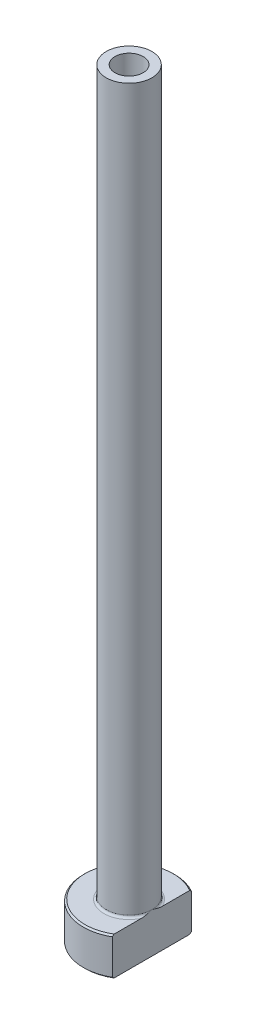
ISO-10303-21;
HEADER;
FILE_DESCRIPTION(('STEP AP214'),'2;1');
FILE_NAME('part.step','',(''),(''),'','','');
FILE_SCHEMA(('AUTOMOTIVE_DESIGN { 1 0 10303 214 1 1 1 1 }'));
ENDSEC;
DATA;
#1=APPLICATION_CONTEXT('core data for automotive mechanical design processes');
#2=APPLICATION_PROTOCOL_DEFINITION('international standard','automotive_design',2000,#1);
#3=PRODUCT_CONTEXT('',#1,'mechanical');
#4=PRODUCT('Part','Part','',(#3));
#5=PRODUCT_RELATED_PRODUCT_CATEGORY('part','',(#4));
#6=PRODUCT_DEFINITION_FORMATION('','',#4);
#7=PRODUCT_DEFINITION_CONTEXT('part definition',#1,'design');
#8=PRODUCT_DEFINITION('design','',#6,#7);
#9=PRODUCT_DEFINITION_SHAPE('','',#8);
#10=(LENGTH_UNIT() NAMED_UNIT(*) SI_UNIT(.MILLI.,.METRE.));
#11=(NAMED_UNIT(*) PLANE_ANGLE_UNIT() SI_UNIT($,.RADIAN.));
#12=(NAMED_UNIT(*) SI_UNIT($,.STERADIAN.) SOLID_ANGLE_UNIT());
#13=UNCERTAINTY_MEASURE_WITH_UNIT(LENGTH_MEASURE(1.E-05),#10,'distance_accuracy_value','');
#14=(GEOMETRIC_REPRESENTATION_CONTEXT(3) GLOBAL_UNCERTAINTY_ASSIGNED_CONTEXT((#13)) GLOBAL_UNIT_ASSIGNED_CONTEXT((#10,
#11,#12)) REPRESENTATION_CONTEXT('',''));
#15=CARTESIAN_POINT('',(0.,0.,0.));
#16=DIRECTION('',(0.,0.,1.));
#17=DIRECTION('',(1.,0.,0.));
#18=AXIS2_PLACEMENT_3D('',#15,#16,#17);
#19=CARTESIAN_POINT('',(0.,92.1876809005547,0.));
#20=DIRECTION('',(0.,1.,0.));
#21=DIRECTION('',(0.,0.,1.));
#22=AXIS2_PLACEMENT_3D('',#19,#20,#21);
#23=CYLINDRICAL_SURFACE('',#22,1.84999999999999);
#24=CARTESIAN_POINT('',(0.,100.,0.));
#25=DIRECTION('',(0.,1.,0.));
#26=DIRECTION('',(0.,0.,1.));
#27=AXIS2_PLACEMENT_3D('',#24,#25,#26);
#28=CIRCLE('',#27,1.84999999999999);
#29=CARTESIAN_POINT('',(0.,100.,1.84999999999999));
#30=VERTEX_POINT('',#29);
#31=EDGE_CURVE('E167',#30,#30,#28,.T.);
#32=ORIENTED_EDGE('',*,*,#31,.T.);
#33=EDGE_LOOP('',(#32));
#34=FACE_BOUND('',#33,.T.);
#35=CARTESIAN_POINT('',(0.,55.,0.));
#36=DIRECTION('',(0.,1.,0.));
#37=DIRECTION('',(0.,0.,1.));
#38=AXIS2_PLACEMENT_3D('',#35,#36,#37);
#39=CIRCLE('',#38,1.84999999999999);
#40=CARTESIAN_POINT('',(0.,55.,1.84999999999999));
#41=VERTEX_POINT('',#40);
#42=EDGE_CURVE('E170',#41,#41,#39,.T.);
#43=ORIENTED_EDGE('',*,*,#42,.F.);
#44=EDGE_LOOP('',(#43));
#45=FACE_BOUND('',#44,.T.);
#46=ADVANCED_FACE('F32',(#34,#45),#23,.F.);
#47=CARTESIAN_POINT('',(-1.84999999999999,100.,0.));
#48=DIRECTION('',(0.,1.,0.));
#49=DIRECTION('',(0.,0.,1.));
#50=AXIS2_PLACEMENT_3D('',#47,#48,#49);
#51=PLANE('',#50);
#52=CARTESIAN_POINT('',(0.,100.,0.));
#53=DIRECTION('',(0.,1.,0.));
#54=DIRECTION('',(0.,0.,1.));
#55=AXIS2_PLACEMENT_3D('',#52,#53,#54);
#56=CIRCLE('',#55,3.);
#57=CARTESIAN_POINT('',(0.,100.,3.));
#58=VERTEX_POINT('',#57);
#59=EDGE_CURVE('E174',#58,#58,#56,.T.);
#60=ORIENTED_EDGE('',*,*,#59,.T.);
#61=EDGE_LOOP('',(#60));
#62=FACE_BOUND('',#61,.T.);
#63=ORIENTED_EDGE('',*,*,#31,.F.);
#64=EDGE_LOOP('',(#63));
#65=FACE_BOUND('',#64,.T.);
#66=ADVANCED_FACE('F157',(#62,#65),#51,.T.);
#67=CARTESIAN_POINT('',(0.,92.1876809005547,0.));
#68=DIRECTION('',(0.,1.,0.));
#69=DIRECTION('',(0.,0.,1.));
#70=AXIS2_PLACEMENT_3D('',#67,#68,#69);
#71=CYLINDRICAL_SURFACE('',#70,2.99999999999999);
#72=CARTESIAN_POINT('',(0.,5.3,0.));
#73=DIRECTION('',(0.,1.,0.));
#74=DIRECTION('',(0.,0.,1.));
#75=AXIS2_PLACEMENT_3D('',#72,#73,#74);
#76=CIRCLE('',#75,2.99999999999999);
#77=CARTESIAN_POINT('',(2.99999999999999,5.3,0.));
#78=VERTEX_POINT('',#77);
#79=EDGE_CURVE('E180',#78,#78,#76,.T.);
#80=ORIENTED_EDGE('',*,*,#79,.T.);
#81=EDGE_LOOP('',(#80));
#82=FACE_BOUND('',#81,.T.);
#83=ORIENTED_EDGE('',*,*,#59,.F.);
#84=EDGE_LOOP('',(#83));
#85=FACE_BOUND('',#84,.T.);
#86=ADVANCED_FACE('F162',(#82,#85),#71,.T.);
#87=CARTESIAN_POINT('',(-2.99999999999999,5.,0.));
#88=DIRECTION('',(0.,1.,0.));
#89=DIRECTION('',(0.,0.,1.));
#90=AXIS2_PLACEMENT_3D('',#87,#88,#89);
#91=PLANE('',#90);
#92=DIRECTION('',(0.,0.,1.));
#93=VECTOR('',#92,1.);
#94=CARTESIAN_POINT('',(2.99999999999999,5.,0.));
#95=LINE('',#94,#93);
#96=CARTESIAN_POINT('',(3.,5.,-4.96386945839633));
#97=VERTEX_POINT('',#96);
#98=CARTESIAN_POINT('',(2.99999999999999,5.,-1.37477270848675));
#99=VERTEX_POINT('',#98);
#100=EDGE_CURVE('E54',#97,#99,#95,.T.);
#101=ORIENTED_EDGE('',*,*,#100,.F.);
#102=CARTESIAN_POINT('',(0.,5.,0.));
#103=DIRECTION('',(0.,1.,0.));
#104=DIRECTION('',(0.,0.,1.));
#105=AXIS2_PLACEMENT_3D('',#102,#103,#104);
#106=CIRCLE('',#105,5.79999999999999);
#107=CARTESIAN_POINT('',(2.99999999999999,5.,4.96386945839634));
#108=VERTEX_POINT('',#107);
#109=EDGE_CURVE('E186',#97,#108,#106,.T.);
#110=ORIENTED_EDGE('',*,*,#109,.T.);
#111=CARTESIAN_POINT('',(2.99999999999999,5.,1.37477270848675));
#112=VERTEX_POINT('',#111);
#113=EDGE_CURVE('E134',#112,#108,#95,.T.);
#114=ORIENTED_EDGE('',*,*,#113,.F.);
#115=CARTESIAN_POINT('',(0.,5.,0.));
#116=DIRECTION('',(0.,1.,0.));
#117=DIRECTION('',(0.,0.,1.));
#118=AXIS2_PLACEMENT_3D('',#115,#116,#117);
#119=CIRCLE('',#118,3.29999999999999);
#120=EDGE_CURVE('E183',#112,#99,#119,.F.);
#121=ORIENTED_EDGE('',*,*,#120,.T.);
#122=EDGE_LOOP('',(#101,#110,#114,#121));
#123=FACE_BOUND('',#122,.T.);
#124=ADVANCED_FACE('F197',(#123),#91,.T.);
#125=CARTESIAN_POINT('',(0.,92.1876809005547,0.));
#126=DIRECTION('',(0.,1.,0.));
#127=DIRECTION('',(0.,0.,1.));
#128=AXIS2_PLACEMENT_3D('',#125,#126,#127);
#129=CYLINDRICAL_SURFACE('',#128,5.99999999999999);
#130=DIRECTION('',(0.,-1.,0.));
#131=VECTOR('',#130,1.);
#132=CARTESIAN_POINT('',(2.99999999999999,100.,5.19615242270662));
#133=LINE('',#132,#131);
#134=CARTESIAN_POINT('',(2.99999999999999,4.79999999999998,5.19615242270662));
#135=VERTEX_POINT('',#134);
#136=CARTESIAN_POINT('',(2.99999999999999,0.200000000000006,5.19615242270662));
#137=VERTEX_POINT('',#136);
#138=EDGE_CURVE('E82',#135,#137,#133,.T.);
#139=ORIENTED_EDGE('',*,*,#138,.F.);
#140=CARTESIAN_POINT('',(0.,4.79999999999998,0.));
#141=DIRECTION('',(0.,1.,0.));
#142=DIRECTION('',(0.,0.,1.));
#143=AXIS2_PLACEMENT_3D('',#140,#141,#142);
#144=CIRCLE('',#143,5.99999999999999);
#145=CARTESIAN_POINT('',(3.,4.79999999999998,-5.19615242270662));
#146=VERTEX_POINT('',#145);
#147=EDGE_CURVE('E95',#135,#146,#144,.F.);
#148=ORIENTED_EDGE('',*,*,#147,.T.);
#149=DIRECTION('',(0.,-1.,0.));
#150=VECTOR('',#149,1.);
#151=CARTESIAN_POINT('',(3.,100.,-5.19615242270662));
#152=LINE('',#151,#150);
#153=CARTESIAN_POINT('',(3.,0.200000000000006,-5.19615242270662));
#154=VERTEX_POINT('',#153);
#155=EDGE_CURVE('E192',#146,#154,#152,.T.);
#156=ORIENTED_EDGE('',*,*,#155,.T.);
#157=CARTESIAN_POINT('',(0.,0.200000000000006,0.));
#158=DIRECTION('',(0.,-1.,0.));
#159=DIRECTION('',(0.,0.,-1.));
#160=AXIS2_PLACEMENT_3D('',#157,#158,#159);
#161=CIRCLE('',#160,5.99999999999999);
#162=EDGE_CURVE('E98',#154,#137,#161,.F.);
#163=ORIENTED_EDGE('',*,*,#162,.T.);
#164=EDGE_LOOP('',(#139,#148,#156,#163));
#165=FACE_BOUND('',#164,.T.);
#166=ADVANCED_FACE('F190',(#165),#129,.T.);
#167=CARTESIAN_POINT('',(-5.99999999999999,0.,0.));
#168=DIRECTION('',(0.,-1.,0.));
#169=DIRECTION('',(0.,0.,-1.));
#170=AXIS2_PLACEMENT_3D('',#167,#168,#169);
#171=PLANE('',#170);
#172=CARTESIAN_POINT('',(0.,0.,0.));
#173=DIRECTION('',(0.,-1.,0.));
#174=DIRECTION('',(0.,0.,-1.));
#175=AXIS2_PLACEMENT_3D('',#172,#173,#174);
#176=CIRCLE('',#175,2.59999999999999);
#177=CARTESIAN_POINT('',(0.,0.,-2.59999999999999));
#178=VERTEX_POINT('',#177);
#179=EDGE_CURVE('E40',#178,#178,#176,.F.);
#180=ORIENTED_EDGE('',*,*,#179,.T.);
#181=EDGE_LOOP('',(#180));
#182=FACE_BOUND('',#181,.T.);
#183=DIRECTION('',(0.,0.,-1.));
#184=VECTOR('',#183,1.);
#185=CARTESIAN_POINT('',(2.99999999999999,0.,5.19615242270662));
#186=LINE('',#185,#184);
#187=CARTESIAN_POINT('',(2.99999999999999,0.,4.96386945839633));
#188=VERTEX_POINT('',#187);
#189=CARTESIAN_POINT('',(2.99999999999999,0.,-4.96386945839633));
#190=VERTEX_POINT('',#189);
#191=EDGE_CURVE('E47',#188,#190,#186,.T.);
#192=ORIENTED_EDGE('',*,*,#191,.F.);
#193=CARTESIAN_POINT('',(0.,0.,0.));
#194=DIRECTION('',(0.,-1.,0.));
#195=DIRECTION('',(0.,0.,-1.));
#196=AXIS2_PLACEMENT_3D('',#193,#194,#195);
#197=CIRCLE('',#196,5.79999999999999);
#198=EDGE_CURVE('E92',#188,#190,#197,.T.);
#199=ORIENTED_EDGE('',*,*,#198,.T.);
#200=EDGE_LOOP('',(#192,#199));
#201=FACE_BOUND('',#200,.T.);
#202=ADVANCED_FACE('F91',(#182,#201),#171,.T.);
#203=CARTESIAN_POINT('',(0.,92.1876809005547,0.));
#204=DIRECTION('',(0.,1.,0.));
#205=DIRECTION('',(0.,0.,1.));
#206=AXIS2_PLACEMENT_3D('',#203,#204,#205);
#207=CYLINDRICAL_SURFACE('',#206,2.09999999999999);
#208=CARTESIAN_POINT('',(0.,0.499999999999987,0.));
#209=DIRECTION('',(0.,-1.,0.));
#210=DIRECTION('',(0.,0.,-1.));
#211=AXIS2_PLACEMENT_3D('',#208,#209,#210);
#212=CIRCLE('',#211,2.09999999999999);
#213=CARTESIAN_POINT('',(0.,0.499999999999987,-2.09999999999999));
#214=VERTEX_POINT('',#213);
#215=EDGE_CURVE('E11',#214,#214,#212,.T.);
#216=ORIENTED_EDGE('',*,*,#215,.T.);
#217=EDGE_LOOP('',(#216));
#218=FACE_BOUND('',#217,.T.);
#219=CARTESIAN_POINT('',(0.,43.,0.));
#220=DIRECTION('',(0.,1.,0.));
#221=DIRECTION('',(0.,0.,1.));
#222=AXIS2_PLACEMENT_3D('',#219,#220,#221);
#223=CIRCLE('',#222,2.1);
#224=CARTESIAN_POINT('',(0.,43.,2.1));
#225=VERTEX_POINT('',#224);
#226=EDGE_CURVE('E172',#225,#225,#223,.T.);
#227=ORIENTED_EDGE('',*,*,#226,.T.);
#228=EDGE_LOOP('',(#227));
#229=FACE_BOUND('',#228,.T.);
#230=ADVANCED_FACE('F215',(#218,#229),#207,.F.);
#231=CARTESIAN_POINT('',(0.,43.,0.));
#232=DIRECTION('',(0.,-1.,0.));
#233=DIRECTION('',(0.,0.,-1.));
#234=AXIS2_PLACEMENT_3D('',#231,#232,#233);
#235=CONICAL_SURFACE('',#234,2.1,0.0208303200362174);
#236=ORIENTED_EDGE('',*,*,#42,.T.);
#237=EDGE_LOOP('',(#236));
#238=FACE_BOUND('',#237,.T.);
#239=ORIENTED_EDGE('',*,*,#226,.F.);
#240=EDGE_LOOP('',(#239));
#241=FACE_BOUND('',#240,.T.);
#242=ADVANCED_FACE('F111',(#238,#241),#235,.F.);
#243=CARTESIAN_POINT('',(0.,5.3,0.));
#244=DIRECTION('',(0.,1.,0.));
#245=DIRECTION('',(0.,0.,1.));
#246=AXIS2_PLACEMENT_3D('',#243,#244,#245);
#247=TOROIDAL_SURFACE('',#246,3.29999999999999,0.3);
#248=ORIENTED_EDGE('',*,*,#120,.F.);
#249=CARTESIAN_POINT('',(2.99999999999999,5.3,0.));
#250=CARTESIAN_POINT('',(2.99999999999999,5.3000006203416,-1.12611385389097E-10));
#251=CARTESIAN_POINT('',(2.99999999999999,5.30000124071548,1.79706759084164E-07));
#252=CARTESIAN_POINT('',(2.99999999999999,5.30000241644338,7.12597434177E-07));
#253=CARTESIAN_POINT('',(2.99999999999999,5.30000296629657,1.07470894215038E-06));
#254=CARTESIAN_POINT('',(2.99999999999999,5.30000408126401,1.93940802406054E-06));
#255=CARTESIAN_POINT('',(2.99999999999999,5.30000463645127,2.45488588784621E-06));
#256=CARTESIAN_POINT('',(2.99999999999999,5.30000565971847,3.54465517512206E-06));
#257=CARTESIAN_POINT('',(2.99999999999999,5.30000612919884,4.1177066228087E-06));
#258=CARTESIAN_POINT('',(2.99999999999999,5.30000778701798,6.25396429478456E-06));
#259=CARTESIAN_POINT('',(2.99999999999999,5.30000888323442,7.89070824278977E-06));
#260=CARTESIAN_POINT('',(2.99999999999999,5.30001076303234,1.11998049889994E-05));
#261=CARTESIAN_POINT('',(2.99999999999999,5.30001156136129,1.28642109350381E-05));
#262=CARTESIAN_POINT('',(2.99999999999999,5.30001474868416,1.96537166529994E-05));
#263=CARTESIAN_POINT('',(2.99999999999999,5.30001702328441,2.48380231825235E-05));
#264=CARTESIAN_POINT('',(2.99999999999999,5.30002052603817,3.48178474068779E-05));
#265=CARTESIAN_POINT('',(2.99999999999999,5.30002184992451,3.95800617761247E-05));
#266=CARTESIAN_POINT('',(2.99999999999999,5.30003122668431,7.41814363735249E-05));
#267=CARTESIAN_POINT('',(2.99999999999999,5.30003808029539,0.000104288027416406));
#268=CARTESIAN_POINT('',(2.99999999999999,5.30006804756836,0.000222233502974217));
#269=CARTESIAN_POINT('',(2.99999999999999,5.30009687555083,0.000308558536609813));
#270=CARTESIAN_POINT('',(2.99999999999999,5.30020809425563,0.000648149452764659));
#271=CARTESIAN_POINT('',(2.99999999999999,5.30028657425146,0.000902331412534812));
#272=CARTESIAN_POINT('',(2.99999999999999,5.30059876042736,0.00190491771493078));
#273=CARTESIAN_POINT('',(2.99999999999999,5.30083723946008,0.00265218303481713));
#274=CARTESIAN_POINT('',(2.99999999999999,5.30182192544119,0.0057469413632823));
#275=CARTESIAN_POINT('',(2.99999999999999,5.30256224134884,0.00809584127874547));
#276=CARTESIAN_POINT('',(2.99999999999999,5.31160267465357,0.0367678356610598));
#277=CARTESIAN_POINT('',(2.99999999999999,5.31993817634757,0.0630827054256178));
#278=CARTESIAN_POINT('',(2.99999999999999,5.33621504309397,0.114704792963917));
#279=CARTESIAN_POINT('',(2.99999999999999,5.3441590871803,0.140011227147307));
#280=CARTESIAN_POINT('',(2.99999999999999,5.36094382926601,0.19377488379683));
#281=CARTESIAN_POINT('',(2.99999999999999,5.36977415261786,0.222235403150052));
#282=CARTESIAN_POINT('',(2.99999999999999,5.38736474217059,0.279512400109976));
#283=CARTESIAN_POINT('',(2.99999999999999,5.3961232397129,0.308329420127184));
#284=CARTESIAN_POINT('',(2.99999999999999,5.41726575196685,0.378880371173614));
#285=CARTESIAN_POINT('',(2.99999999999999,5.4295272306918,0.420651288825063));
#286=CARTESIAN_POINT('',(2.99999999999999,5.45309597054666,0.50335758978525));
#287=CARTESIAN_POINT('',(2.99999999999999,5.46441924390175,0.544288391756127));
#288=CARTESIAN_POINT('',(2.99999999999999,5.48778169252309,0.632156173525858));
#289=CARTESIAN_POINT('',(2.99999999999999,5.49969678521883,0.67912648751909));
#290=CARTESIAN_POINT('',(2.99999999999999,5.52221484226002,0.773740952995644));
#291=CARTESIAN_POINT('',(2.99999999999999,5.532807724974,0.821387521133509));
#292=CARTESIAN_POINT('',(2.99999999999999,5.55291503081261,0.920589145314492));
#293=CARTESIAN_POINT('',(2.99999999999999,5.5622918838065,0.972172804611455));
#294=CARTESIAN_POINT('',(2.99999999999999,5.57838694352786,1.07574836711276));
#295=CARTESIAN_POINT('',(2.99999999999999,5.58510535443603,1.12774023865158));
#296=CARTESIAN_POINT('',(2.99999999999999,5.59681427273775,1.24924411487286));
#297=CARTESIAN_POINT('',(2.99999999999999,5.60051317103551,1.31890364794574));
#298=CARTESIAN_POINT('',(2.99999999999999,5.59966579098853,1.42270835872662));
#299=CARTESIAN_POINT('',(2.99999999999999,5.59835823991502,1.45688093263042));
#300=CARTESIAN_POINT('',(2.99999999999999,5.59322745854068,1.52502533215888));
#301=CARTESIAN_POINT('',(2.99999999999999,5.58940645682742,1.5589973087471));
#302=CARTESIAN_POINT('',(2.99999999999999,5.57976146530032,1.61947815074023));
#303=CARTESIAN_POINT('',(2.99999999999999,5.5745150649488,1.64607760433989));
#304=CARTESIAN_POINT('',(2.99999999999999,5.56161153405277,1.69883648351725));
#305=CARTESIAN_POINT('',(2.99999999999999,5.55394338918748,1.7249933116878));
#306=CARTESIAN_POINT('',(2.99999999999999,5.53555176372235,1.77650913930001));
#307=CARTESIAN_POINT('',(2.99999999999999,5.52480031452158,1.80185836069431));
#308=CARTESIAN_POINT('',(2.99999999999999,5.49948027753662,1.85054545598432));
#309=CARTESIAN_POINT('',(2.99999999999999,5.48493141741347,1.87389291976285));
#310=CARTESIAN_POINT('',(2.99999999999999,5.45992470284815,1.90552135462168));
#311=CARTESIAN_POINT('',(2.99999999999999,5.45133318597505,1.91527363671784));
#312=CARTESIAN_POINT('',(2.99999999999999,5.43294163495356,1.93360072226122));
#313=CARTESIAN_POINT('',(2.99999999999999,5.42314083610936,1.94217477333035));
#314=CARTESIAN_POINT('',(2.99999999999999,5.40215892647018,1.95778354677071));
#315=CARTESIAN_POINT('',(2.99999999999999,5.39096156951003,1.96479687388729));
#316=CARTESIAN_POINT('',(2.99999999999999,5.36742144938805,1.97652218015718));
#317=CARTESIAN_POINT('',(2.99999999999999,5.35508207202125,1.98124071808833));
#318=CARTESIAN_POINT('',(2.99999999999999,5.33320117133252,1.98690185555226));
#319=CARTESIAN_POINT('',(2.99999999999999,5.32383559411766,1.98852953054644));
#320=CARTESIAN_POINT('',(2.99999999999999,5.30496375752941,1.99016898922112));
#321=CARTESIAN_POINT('',(2.99999999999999,5.29545756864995,1.99018155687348));
#322=CARTESIAN_POINT('',(2.99999999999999,5.27659318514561,1.98858978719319));
#323=CARTESIAN_POINT('',(2.99999999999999,5.26723486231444,1.9869869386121));
#324=CARTESIAN_POINT('',(2.99999999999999,5.24889957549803,1.98229727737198));
#325=CARTESIAN_POINT('',(2.99999999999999,5.23992286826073,1.97920948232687));
#326=CARTESIAN_POINT('',(2.99999999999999,5.21981293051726,1.97059641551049));
#327=CARTESIAN_POINT('',(2.99999999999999,5.20887713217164,1.96461176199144));
#328=CARTESIAN_POINT('',(2.99999999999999,5.18811536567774,1.95095727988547));
#329=CARTESIAN_POINT('',(2.99999999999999,5.17829177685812,1.94328393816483));
#330=CARTESIAN_POINT('',(2.99999999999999,5.15512177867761,1.9225422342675));
#331=CARTESIAN_POINT('',(2.99999999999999,5.14247568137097,1.90869680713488));
#332=CARTESIAN_POINT('',(2.99999999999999,5.11944595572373,1.87927587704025));
#333=CARTESIAN_POINT('',(2.99999999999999,5.10906527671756,1.86369815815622));
#334=CARTESIAN_POINT('',(2.99999999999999,5.08309609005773,1.81927355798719));
#335=CARTESIAN_POINT('',(2.99999999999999,5.06948546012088,1.78928084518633));
#336=CARTESIAN_POINT('',(2.99999999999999,5.04658664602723,1.72751962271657));
#337=CARTESIAN_POINT('',(2.99999999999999,5.03733582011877,1.69573828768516));
#338=CARTESIAN_POINT('',(2.99999999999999,5.02214318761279,1.63079918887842));
#339=CARTESIAN_POINT('',(2.99999999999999,5.0162653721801,1.59762686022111));
#340=CARTESIAN_POINT('',(2.99999999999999,5.00734002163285,1.53086029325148));
#341=CARTESIAN_POINT('',(2.99999999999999,5.00429797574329,1.49726536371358));
#342=CARTESIAN_POINT('',(2.99999999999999,5.00059037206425,1.4310087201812));
#343=CARTESIAN_POINT('',(2.99999999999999,4.99985343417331,1.39835069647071));
#344=CARTESIAN_POINT('',(2.99999999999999,5.00019322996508,1.33318312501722));
#345=CARTESIAN_POINT('',(2.99999999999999,5.00126261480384,1.30067351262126));
#346=CARTESIAN_POINT('',(2.99999999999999,5.00569854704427,1.2219046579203));
#347=CARTESIAN_POINT('',(2.99999999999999,5.00984986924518,1.17569031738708));
#348=CARTESIAN_POINT('',(2.99999999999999,5.0206087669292,1.08357061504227));
#349=CARTESIAN_POINT('',(2.99999999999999,5.02721586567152,1.03766519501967));
#350=CARTESIAN_POINT('',(2.99999999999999,5.04258096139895,0.945130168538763));
#351=CARTESIAN_POINT('',(2.99999999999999,5.05138514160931,0.898508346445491));
#352=CARTESIAN_POINT('',(2.99999999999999,5.07066869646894,0.805496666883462));
#353=CARTESIAN_POINT('',(2.99999999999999,5.08115218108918,0.759107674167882));
#354=CARTESIAN_POINT('',(2.99999999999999,5.10738921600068,0.650207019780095));
#355=CARTESIAN_POINT('',(2.99999999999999,5.12369110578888,0.587828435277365));
#356=CARTESIAN_POINT('',(2.99999999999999,5.15777680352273,0.464212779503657));
#357=CARTESIAN_POINT('',(2.99999999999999,5.17554263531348,0.402970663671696));
#358=CARTESIAN_POINT('',(2.99999999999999,5.21006724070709,0.287596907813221));
#359=CARTESIAN_POINT('',(2.99999999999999,5.22671796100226,0.233432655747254));
#360=CARTESIAN_POINT('',(2.99999999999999,5.25241226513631,0.150940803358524));
#361=CARTESIAN_POINT('',(2.99999999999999,5.26131063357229,0.122567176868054));
#362=CARTESIAN_POINT('',(2.99999999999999,5.27905176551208,0.0662804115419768));
#363=CARTESIAN_POINT('',(2.99999999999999,5.28789327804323,0.0383669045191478));
#364=CARTESIAN_POINT('',(2.99999999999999,5.29743877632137,0.00809257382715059));
#365=CARTESIAN_POINT('',(2.99999999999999,5.298180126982,0.00574041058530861));
#366=CARTESIAN_POINT('',(2.99999999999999,5.2991650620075,0.00264489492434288));
#367=CARTESIAN_POINT('',(2.99999999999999,5.29940274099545,0.00190013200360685));
#368=CARTESIAN_POINT('',(2.99999999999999,5.29971394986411,0.000900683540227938));
#369=CARTESIAN_POINT('',(2.99999999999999,5.29979223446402,0.000647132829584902));
#370=CARTESIAN_POINT('',(2.99999999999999,5.29990321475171,0.000308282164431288));
#371=CARTESIAN_POINT('',(2.99999999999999,5.29993200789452,0.000222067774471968));
#372=CARTESIAN_POINT('',(2.99999999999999,5.29996194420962,0.000104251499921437));
#373=CARTESIAN_POINT('',(2.99999999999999,5.29996879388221,7.41614201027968E-05));
#374=CARTESIAN_POINT('',(2.99999999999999,5.29997816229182,3.95766681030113E-05));
#375=CARTESIAN_POINT('',(2.99999999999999,5.29997948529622,3.48154638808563E-05));
#376=CARTESIAN_POINT('',(2.99999999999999,5.2999829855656,2.48376256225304E-05));
#377=CARTESIAN_POINT('',(2.99999999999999,5.29998525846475,1.96542435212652E-05));
#378=CARTESIAN_POINT('',(2.99999999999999,5.29998844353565,1.2865664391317E-05));
#379=CARTESIAN_POINT('',(2.99999999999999,5.29998924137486,1.12013338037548E-05));
#380=CARTESIAN_POINT('',(2.99999999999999,5.29999112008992,7.89229927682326E-06));
#381=CARTESIAN_POINT('',(2.99999999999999,5.29999221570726,6.25553453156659E-06));
#382=CARTESIAN_POINT('',(2.99999999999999,5.29999387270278,4.11914316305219E-06));
#383=CARTESIAN_POINT('',(2.99999999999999,5.29999434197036,3.54603043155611E-06));
#384=CARTESIAN_POINT('',(2.99999999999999,5.29999536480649,2.4561002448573E-06));
#385=CARTESIAN_POINT('',(2.99999999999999,5.29999591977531,1.9405219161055E-06));
#386=CARTESIAN_POINT('',(2.99999999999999,5.29999703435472,1.07558297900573E-06));
#387=CARTESIAN_POINT('',(2.99999999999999,5.29999758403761,7.13339240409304E-07));
#388=CARTESIAN_POINT('',(2.99999999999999,5.29999875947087,1.80121854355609E-07));
#389=CARTESIAN_POINT('',(2.99999999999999,5.2999993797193,1.12600830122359E-10));
#390=CARTESIAN_POINT('',(2.99999999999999,5.3,0.));
#391=B_SPLINE_CURVE_WITH_KNOTS('',3,(#249,#250,#251,#252,#253,#254,#255,#256,#257,#258,#259,
#260,#261,#262,#263,#264,#265,#266,#267,#268,#269,#270,#271,#272,#273,#274,#275,#276,#277,#278,
#279,#280,#281,#282,#283,#284,#285,#286,#287,#288,#289,#290,#291,#292,#293,#294,#295,#296,#297,
#298,#299,#300,#301,#302,#303,#304,#305,#306,#307,#308,#309,#310,#311,#312,#313,#314,#315,#316,
#317,#318,#319,#320,#321,#322,#323,#324,#325,#326,#327,#328,#329,#330,#331,#332,#333,#334,#335,
#336,#337,#338,#339,#340,#341,#342,#343,#344,#345,#346,#347,#348,#349,#350,#351,#352,#353,#354,
#355,#356,#357,#358,#359,#360,#361,#362,#363,#364,#365,#366,#367,#368,#369,#370,#371,#372,#373,
#374,#375,#376,#377,#378,#379,#380,#381,#382,#383,#384,#385,#386,#387,#388,#389,#390),
.UNSPECIFIED.,.T.,.F.,(4,2,2,2,2,2,2,2,2,2,2,2,2,2,2,2,2,2,2,2,2,2,2,2,2,2,2,2,2,2,2,2,2,2,2,2,
2,2,2,2,2,2,2,2,2,2,2,2,2,2,2,2,2,2,2,2,2,2,2,2,2,2,2,2,2,2,2,2,2,2,4),(0.,1.86513959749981E-06,
3.83353422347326E-06,6.09513468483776E-06,8.31560835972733E-06,1.42000733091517E-05,
1.97335541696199E-05,3.66769904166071E-05,5.1485836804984E-05,0.000144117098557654,
0.000416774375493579,0.00121521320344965,0.00356794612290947,0.0109568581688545,
0.0937636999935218,0.173336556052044,0.262732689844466,0.353088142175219,0.483684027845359,
0.611082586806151,0.756439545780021,0.90284470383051,1.06007042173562,1.21728406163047,
1.42611662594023,1.52864191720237,1.63107642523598,1.7123285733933,1.79395571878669,
1.87634808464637,1.95832065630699,1.99722769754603,2.03615946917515,2.07559591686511,
2.1149189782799,2.1433091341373,2.17168550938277,2.20003575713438,2.22840478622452,
2.26559554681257,2.30286442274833,2.35880214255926,2.41481225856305,2.51307007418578,
2.6121551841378,2.71306273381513,2.81416520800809,2.91210427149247,3.00964583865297,
3.14875779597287,3.28784276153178,3.43014232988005,3.57279564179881,3.76617940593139,
3.95746724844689,4.1274607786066,4.21667041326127,4.30450746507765,4.3119066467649,
4.31425150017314,4.31504795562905,4.3153202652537,4.31541284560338,4.31542765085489,
4.31544458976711,4.31545012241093,4.31545600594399,4.3154582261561,4.31546048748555,
4.3154624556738,4.31546432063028),.UNSPECIFIED.);
#392=EDGE_CURVE('E126',#112,#78,#391,.T.);
#393=ORIENTED_EDGE('',*,*,#392,.T.);
#394=ORIENTED_EDGE('',*,*,#79,.F.);
#395=CARTESIAN_POINT('',(2.99999999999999,5.3,0.));
#396=CARTESIAN_POINT('',(2.99999999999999,5.2999993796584,1.12611872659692E-10));
#397=CARTESIAN_POINT('',(2.99999999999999,5.29999875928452,-1.7970675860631E-07));
#398=CARTESIAN_POINT('',(2.99999999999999,5.29999758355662,-7.12597433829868E-07));
#399=CARTESIAN_POINT('',(2.99999999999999,5.29999703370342,-1.07470894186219E-06));
#400=CARTESIAN_POINT('',(2.99999999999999,5.29999591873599,-1.93940802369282E-06));
#401=CARTESIAN_POINT('',(2.99999999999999,5.29999536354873,-2.45488588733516E-06));
#402=CARTESIAN_POINT('',(2.99999999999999,5.29999434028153,-3.5446551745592E-06));
#403=CARTESIAN_POINT('',(2.99999999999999,5.29999387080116,-4.11770662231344E-06));
#404=CARTESIAN_POINT('',(2.99999999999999,5.29999221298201,-6.25396429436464E-06));
#405=CARTESIAN_POINT('',(2.99999999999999,5.29999111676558,-7.89070824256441E-06));
#406=CARTESIAN_POINT('',(2.99999999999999,5.29998923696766,-1.11998049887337E-05));
#407=CARTESIAN_POINT('',(2.99999999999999,5.29998843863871,-1.28642109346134E-05));
#408=CARTESIAN_POINT('',(2.99999999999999,5.29998525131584,-1.9653716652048E-05));
#409=CARTESIAN_POINT('',(2.99999999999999,5.29998297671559,-2.48380231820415E-05));
#410=CARTESIAN_POINT('',(2.99999999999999,5.29997947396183,-3.48178474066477E-05));
#411=CARTESIAN_POINT('',(2.99999999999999,5.29997815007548,-3.95800617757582E-05));
#412=CARTESIAN_POINT('',(2.99999999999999,5.29996877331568,-7.41814363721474E-05));
#413=CARTESIAN_POINT('',(2.99999999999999,5.29996191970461,-0.000104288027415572));
#414=CARTESIAN_POINT('',(2.99999999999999,5.29993195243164,-0.000222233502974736));
#415=CARTESIAN_POINT('',(2.99999999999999,5.29990312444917,-0.000308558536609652));
#416=CARTESIAN_POINT('',(2.99999999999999,5.29979190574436,-0.000648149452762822));
#417=CARTESIAN_POINT('',(2.99999999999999,5.29971342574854,-0.000902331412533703));
#418=CARTESIAN_POINT('',(2.99999999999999,5.29940123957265,-0.00190491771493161));
#419=CARTESIAN_POINT('',(2.99999999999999,5.29916276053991,-0.00265218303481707));
#420=CARTESIAN_POINT('',(2.99999999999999,5.2981780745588,-0.00574694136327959));
#421=CARTESIAN_POINT('',(2.99999999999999,5.29743775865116,-0.00809584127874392));
#422=CARTESIAN_POINT('',(2.99999999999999,5.28839732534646,-0.0367678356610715));
#423=CARTESIAN_POINT('',(2.99999999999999,5.28006182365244,-0.0630827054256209));
#424=CARTESIAN_POINT('',(2.99999999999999,5.26378495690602,-0.114704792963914));
#425=CARTESIAN_POINT('',(2.99999999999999,5.2558409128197,-0.140011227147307));
#426=CARTESIAN_POINT('',(2.99999999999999,5.23905617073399,-0.193774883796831));
#427=CARTESIAN_POINT('',(2.99999999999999,5.23022584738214,-0.222235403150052));
#428=CARTESIAN_POINT('',(2.99999999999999,5.2126352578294,-0.279512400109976));
#429=CARTESIAN_POINT('',(2.99999999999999,5.2038767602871,-0.308329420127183));
#430=CARTESIAN_POINT('',(2.99999999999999,5.18273424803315,-0.378880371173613));
#431=CARTESIAN_POINT('',(2.99999999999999,5.1704727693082,-0.420651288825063));
#432=CARTESIAN_POINT('',(2.99999999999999,5.14690402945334,-0.50335758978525));
#433=CARTESIAN_POINT('',(2.99999999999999,5.13558075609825,-0.544288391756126));
#434=CARTESIAN_POINT('',(2.99999999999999,5.11221830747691,-0.632156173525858));
#435=CARTESIAN_POINT('',(2.99999999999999,5.10030321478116,-0.679126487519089));
#436=CARTESIAN_POINT('',(2.99999999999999,5.07778515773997,-0.773740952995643));
#437=CARTESIAN_POINT('',(2.99999999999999,5.067192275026,-0.821387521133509));
#438=CARTESIAN_POINT('',(2.99999999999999,5.04708496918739,-0.920589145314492));
#439=CARTESIAN_POINT('',(2.99999999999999,5.0377081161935,-0.972172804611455));
#440=CARTESIAN_POINT('',(2.99999999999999,5.02161305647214,-1.07574836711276));
#441=CARTESIAN_POINT('',(2.99999999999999,5.01489464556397,-1.12774023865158));
#442=CARTESIAN_POINT('',(2.99999999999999,5.00318572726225,-1.24924411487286));
#443=CARTESIAN_POINT('',(2.99999999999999,4.99948682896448,-1.31890364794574));
#444=CARTESIAN_POINT('',(2.99999999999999,5.00033420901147,-1.42270835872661));
#445=CARTESIAN_POINT('',(2.99999999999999,5.00164176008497,-1.45688093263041));
#446=CARTESIAN_POINT('',(2.99999999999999,5.00677254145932,-1.52502533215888));
#447=CARTESIAN_POINT('',(2.99999999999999,5.01059354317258,-1.5589973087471));
#448=CARTESIAN_POINT('',(2.99999999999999,5.02023853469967,-1.61947815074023));
#449=CARTESIAN_POINT('',(2.99999999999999,5.0254849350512,-1.64607760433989));
#450=CARTESIAN_POINT('',(2.99999999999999,5.03838846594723,-1.69883648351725));
#451=CARTESIAN_POINT('',(2.99999999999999,5.04605661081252,-1.7249933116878));
#452=CARTESIAN_POINT('',(2.99999999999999,5.06444823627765,-1.77650913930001));
#453=CARTESIAN_POINT('',(2.99999999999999,5.07519968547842,-1.80185836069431));
#454=CARTESIAN_POINT('',(2.99999999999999,5.10051972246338,-1.85054545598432));
#455=CARTESIAN_POINT('',(2.99999999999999,5.11506858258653,-1.87389291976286));
#456=CARTESIAN_POINT('',(2.99999999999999,5.14007529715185,-1.90552135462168));
#457=CARTESIAN_POINT('',(2.99999999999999,5.14866681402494,-1.91527363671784));
#458=CARTESIAN_POINT('',(2.99999999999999,5.16705836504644,-1.93360072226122));
#459=CARTESIAN_POINT('',(2.99999999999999,5.17685916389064,-1.94217477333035));
#460=CARTESIAN_POINT('',(2.99999999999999,5.19784107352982,-1.95778354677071));
#461=CARTESIAN_POINT('',(2.99999999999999,5.20903843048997,-1.96479687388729));
#462=CARTESIAN_POINT('',(2.99999999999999,5.23257855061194,-1.97652218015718));
#463=CARTESIAN_POINT('',(2.99999999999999,5.24491792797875,-1.98124071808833));
#464=CARTESIAN_POINT('',(2.99999999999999,5.26679882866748,-1.98690185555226));
#465=CARTESIAN_POINT('',(2.99999999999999,5.27616440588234,-1.98852953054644));
#466=CARTESIAN_POINT('',(2.99999999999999,5.29503624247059,-1.99016898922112));
#467=CARTESIAN_POINT('',(2.99999999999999,5.30454243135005,-1.99018155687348));
#468=CARTESIAN_POINT('',(2.99999999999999,5.32340681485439,-1.98858978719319));
#469=CARTESIAN_POINT('',(2.99999999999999,5.33276513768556,-1.9869869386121));
#470=CARTESIAN_POINT('',(2.99999999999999,5.35110042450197,-1.98229727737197));
#471=CARTESIAN_POINT('',(2.99999999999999,5.36007713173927,-1.97920948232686));
#472=CARTESIAN_POINT('',(2.99999999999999,5.38018706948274,-1.97059641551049));
#473=CARTESIAN_POINT('',(2.99999999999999,5.39112286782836,-1.96461176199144));
#474=CARTESIAN_POINT('',(2.99999999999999,5.41188463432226,-1.95095727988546));
#475=CARTESIAN_POINT('',(2.99999999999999,5.42170822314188,-1.94328393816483));
#476=CARTESIAN_POINT('',(2.99999999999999,5.44487822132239,-1.9225422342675));
#477=CARTESIAN_POINT('',(2.99999999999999,5.45752431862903,-1.90869680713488));
#478=CARTESIAN_POINT('',(2.99999999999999,5.48055404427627,-1.87927587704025));
#479=CARTESIAN_POINT('',(2.99999999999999,5.49093472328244,-1.86369815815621));
#480=CARTESIAN_POINT('',(2.99999999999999,5.51690390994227,-1.81927355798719));
#481=CARTESIAN_POINT('',(2.99999999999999,5.53051453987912,-1.78928084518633));
#482=CARTESIAN_POINT('',(2.99999999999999,5.55341335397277,-1.72751962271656));
#483=CARTESIAN_POINT('',(2.99999999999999,5.56266417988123,-1.69573828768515));
#484=CARTESIAN_POINT('',(2.99999999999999,5.57785681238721,-1.63079918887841));
#485=CARTESIAN_POINT('',(2.99999999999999,5.5837346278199,-1.5976268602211));
#486=CARTESIAN_POINT('',(2.99999999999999,5.59265997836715,-1.53086029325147));
#487=CARTESIAN_POINT('',(2.99999999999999,5.59570202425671,-1.49726536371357));
#488=CARTESIAN_POINT('',(2.99999999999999,5.59940962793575,-1.43100872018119));
#489=CARTESIAN_POINT('',(2.99999999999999,5.60014656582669,-1.3983506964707));
#490=CARTESIAN_POINT('',(2.99999999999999,5.59980677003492,-1.33318312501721));
#491=CARTESIAN_POINT('',(2.99999999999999,5.59873738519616,-1.30067351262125));
#492=CARTESIAN_POINT('',(2.99999999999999,5.59430145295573,-1.22190465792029));
#493=CARTESIAN_POINT('',(2.99999999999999,5.59015013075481,-1.17569031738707));
#494=CARTESIAN_POINT('',(2.99999999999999,5.5793912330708,-1.08357061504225));
#495=CARTESIAN_POINT('',(2.99999999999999,5.57278413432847,-1.03766519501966));
#496=CARTESIAN_POINT('',(2.99999999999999,5.55741903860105,-0.945130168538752));
#497=CARTESIAN_POINT('',(2.99999999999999,5.54861485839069,-0.898508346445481));
#498=CARTESIAN_POINT('',(2.99999999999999,5.52933130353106,-0.805496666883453));
#499=CARTESIAN_POINT('',(2.99999999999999,5.51884781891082,-0.759107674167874));
#500=CARTESIAN_POINT('',(2.99999999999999,5.49261078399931,-0.650207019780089));
#501=CARTESIAN_POINT('',(2.99999999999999,5.47630889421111,-0.587828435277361));
#502=CARTESIAN_POINT('',(2.99999999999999,5.44222319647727,-0.464212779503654));
#503=CARTESIAN_POINT('',(2.99999999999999,5.42445736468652,-0.402970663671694));
#504=CARTESIAN_POINT('',(2.99999999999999,5.38993275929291,-0.287596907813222));
#505=CARTESIAN_POINT('',(2.99999999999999,5.37328203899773,-0.233432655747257));
#506=CARTESIAN_POINT('',(2.99999999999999,5.34758773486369,-0.150940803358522));
#507=CARTESIAN_POINT('',(2.99999999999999,5.33868936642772,-0.122567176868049));
#508=CARTESIAN_POINT('',(2.99999999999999,5.32094823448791,-0.0662804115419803));
#509=CARTESIAN_POINT('',(2.99999999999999,5.31210672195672,-0.0383669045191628));
#510=CARTESIAN_POINT('',(2.99999999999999,5.30256122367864,-0.00809257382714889));
#511=CARTESIAN_POINT('',(2.99999999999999,5.30181987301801,-0.00574041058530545));
#512=CARTESIAN_POINT('',(2.99999999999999,5.30083493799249,-0.00264489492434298));
#513=CARTESIAN_POINT('',(2.99999999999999,5.30059725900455,-0.00190013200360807));
#514=CARTESIAN_POINT('',(2.99999999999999,5.30028605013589,-0.000900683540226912));
#515=CARTESIAN_POINT('',(2.99999999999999,5.30020776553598,-0.000647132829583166));
#516=CARTESIAN_POINT('',(2.99999999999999,5.30009678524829,-0.000308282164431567));
#517=CARTESIAN_POINT('',(2.99999999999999,5.30006799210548,-0.000222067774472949));
#518=CARTESIAN_POINT('',(2.99999999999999,5.30003805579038,-0.000104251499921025));
#519=CARTESIAN_POINT('',(2.99999999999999,5.30003120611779,-7.41614201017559E-05));
#520=CARTESIAN_POINT('',(2.99999999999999,5.30002183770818,-3.95766681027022E-05));
#521=CARTESIAN_POINT('',(2.99999999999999,5.30002051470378,-3.48154638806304E-05));
#522=CARTESIAN_POINT('',(2.99999999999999,5.30001701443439,-2.48376256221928E-05));
#523=CARTESIAN_POINT('',(2.99999999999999,5.30001474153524,-1.96542435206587E-05));
#524=CARTESIAN_POINT('',(2.99999999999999,5.30001155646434,-1.28656643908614E-05));
#525=CARTESIAN_POINT('',(2.99999999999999,5.30001075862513,-1.12013338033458E-05));
#526=CARTESIAN_POINT('',(2.99999999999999,5.30000887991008,-7.89229927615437E-06));
#527=CARTESIAN_POINT('',(2.99999999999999,5.30000778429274,-6.25553453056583E-06));
#528=CARTESIAN_POINT('',(2.99999999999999,5.30000612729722,-4.11914316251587E-06));
#529=CARTESIAN_POINT('',(2.99999999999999,5.30000565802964,-3.54603043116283E-06));
#530=CARTESIAN_POINT('',(2.99999999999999,5.3000046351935,-2.45610024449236E-06));
#531=CARTESIAN_POINT('',(2.99999999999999,5.30000408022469,-1.94052191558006E-06));
#532=CARTESIAN_POINT('',(2.99999999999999,5.30000296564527,-1.07558297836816E-06));
#533=CARTESIAN_POINT('',(2.99999999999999,5.30000241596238,-7.13339239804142E-07));
#534=CARTESIAN_POINT('',(2.99999999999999,5.30000124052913,-1.80121853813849E-07));
#535=CARTESIAN_POINT('',(2.99999999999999,5.3000006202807,-1.12600315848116E-10));
#536=CARTESIAN_POINT('',(2.99999999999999,5.3,0.));
#537=B_SPLINE_CURVE_WITH_KNOTS('',3,(#395,#396,#397,#398,#399,#400,#401,#402,#403,#404,#405,
#406,#407,#408,#409,#410,#411,#412,#413,#414,#415,#416,#417,#418,#419,#420,#421,#422,#423,#424,
#425,#426,#427,#428,#429,#430,#431,#432,#433,#434,#435,#436,#437,#438,#439,#440,#441,#442,#443,
#444,#445,#446,#447,#448,#449,#450,#451,#452,#453,#454,#455,#456,#457,#458,#459,#460,#461,#462,
#463,#464,#465,#466,#467,#468,#469,#470,#471,#472,#473,#474,#475,#476,#477,#478,#479,#480,#481,
#482,#483,#484,#485,#486,#487,#488,#489,#490,#491,#492,#493,#494,#495,#496,#497,#498,#499,#500,
#501,#502,#503,#504,#505,#506,#507,#508,#509,#510,#511,#512,#513,#514,#515,#516,#517,#518,#519,
#520,#521,#522,#523,#524,#525,#526,#527,#528,#529,#530,#531,#532,#533,#534,#535,#536),
.UNSPECIFIED.,.T.,.F.,(4,2,2,2,2,2,2,2,2,2,2,2,2,2,2,2,2,2,2,2,2,2,2,2,2,2,2,2,2,2,2,2,2,2,2,2,
2,2,2,2,2,2,2,2,2,2,2,2,2,2,2,2,2,2,2,2,2,2,2,2,2,2,2,2,2,2,2,2,2,2,4),(0.,1.86513959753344E-06,
3.83353422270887E-06,6.09513468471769E-06,8.31560835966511E-06,1.42000733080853E-05,
1.97335541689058E-05,3.6676990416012E-05,5.14858368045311E-05,0.000144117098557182,
0.000416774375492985,0.00121521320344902,0.00356794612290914,0.010956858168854,
0.0937636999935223,0.173336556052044,0.262732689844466,0.353088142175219,0.483684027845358,
0.611082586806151,0.75643954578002,0.902844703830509,1.06007042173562,1.21728406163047,
1.42611662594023,1.52864191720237,1.63107642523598,1.7123285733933,1.79395571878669,
1.87634808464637,1.958320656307,1.99722769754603,2.03615946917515,2.07559591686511,
2.1149189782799,2.1433091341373,2.17168550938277,2.20003575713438,2.22840478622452,
2.26559554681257,2.30286442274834,2.35880214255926,2.41481225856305,2.51307007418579,
2.6121551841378,2.71306273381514,2.8141652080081,2.91210427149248,3.00964583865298,
3.14875779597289,3.28784276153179,3.43014232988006,3.57279564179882,3.76617940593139,
3.95746724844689,4.1274607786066,4.21667041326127,4.30450746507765,4.3119066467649,
4.31425150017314,4.31504795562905,4.3153202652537,4.31541284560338,4.31542765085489,
4.31544458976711,4.31545012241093,4.31545600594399,4.3154582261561,4.31546048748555,
4.3154624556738,4.31546432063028),.UNSPECIFIED.);
#538=EDGE_CURVE('E135',#78,#99,#537,.T.);
#539=ORIENTED_EDGE('',*,*,#538,.T.);
#540=EDGE_LOOP('',(#248,#393,#394,#539));
#541=FACE_BOUND('',#540,.T.);
#542=ADVANCED_FACE('F141',(#541),#247,.F.);
#543=CARTESIAN_POINT('',(0.,5.,0.));
#544=DIRECTION('',(0.,-1.,0.));
#545=DIRECTION('',(0.,0.,-1.));
#546=AXIS2_PLACEMENT_3D('',#543,#544,#545);
#547=CONICAL_SURFACE('',#546,5.79999999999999,0.785398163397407);
#548=CARTESIAN_POINT('',(3.,-1.01993959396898,-11.432889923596));
#549=CARTESIAN_POINT('',(3.,-0.769424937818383,-11.1738796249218));
#550=CARTESIAN_POINT('',(3.,-0.519179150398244,-10.9146084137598));
#551=CARTESIAN_POINT('',(3.,-0.0193842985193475,-10.395389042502));
#552=CARTESIAN_POINT('',(3.,0.230164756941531,-10.1354408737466));
#553=CARTESIAN_POINT('',(3.,0.728528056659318,-9.61458602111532));
#554=CARTESIAN_POINT('',(3.,0.977341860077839,-9.353678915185));
#555=CARTESIAN_POINT('',(3.,1.4738696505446,-8.83082274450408));
#556=CARTESIAN_POINT('',(3.,1.72158364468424,-8.56887368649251));
#557=CARTESIAN_POINT('',(3.,2.21069282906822,-8.04884148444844));
#558=CARTESIAN_POINT('',(3.,2.45211594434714,-7.79078462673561));
#559=CARTESIAN_POINT('',(3.,2.93315589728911,-7.2729934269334));
#560=CARTESIAN_POINT('',(3.,3.17277274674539,-7.01325909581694));
#561=CARTESIAN_POINT('',(3.,3.64950020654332,-6.49159990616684));
#562=CARTESIAN_POINT('',(3.,3.8866113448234,-6.22967553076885));
#563=CARTESIAN_POINT('',(3.,4.35738571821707,-5.70275148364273));
#564=CARTESIAN_POINT('',(3.,4.59104909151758,-5.43775193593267));
#565=CARTESIAN_POINT('',(3.,4.96416348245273,-5.00636825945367));
#566=CARTESIAN_POINT('',(3.,5.10520133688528,-4.84135845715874));
#567=CARTESIAN_POINT('',(3.,5.38476673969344,-4.50919282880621));
#568=CARTESIAN_POINT('',(3.,5.52329404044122,-4.34203679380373));
#569=CARTESIAN_POINT('',(3.,5.79842961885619,-4.00319933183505));
#570=CARTESIAN_POINT('',(3.,5.93500216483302,-3.83148875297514));
#571=CARTESIAN_POINT('',(3.,6.20336281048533,-3.4844211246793));
#572=CARTESIAN_POINT('',(3.,6.33515205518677,-3.30906496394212));
#573=CARTESIAN_POINT('',(3.,6.593933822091,-2.95070802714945));
#574=CARTESIAN_POINT('',(2.99999999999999,6.720823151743,-2.76763161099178));
#575=CARTESIAN_POINT('',(2.99999999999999,6.90336321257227,-2.48771743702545));
#576=CARTESIAN_POINT('',(2.99999999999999,6.96295431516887,-2.39345390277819));
#577=CARTESIAN_POINT('',(2.99999999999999,7.07882720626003,-2.20292146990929));
#578=CARTESIAN_POINT('',(2.99999999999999,7.13510937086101,-2.10665280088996));
#579=CARTESIAN_POINT('',(2.99999999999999,7.24288059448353,-1.91297779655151));
#580=CARTESIAN_POINT('',(2.99999999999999,7.2944198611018,-1.81559978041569));
#581=CARTESIAN_POINT('',(2.99999999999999,7.39241237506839,-1.61833215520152));
#582=CARTESIAN_POINT('',(2.99999999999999,7.43886469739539,-1.51844209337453));
#583=CARTESIAN_POINT('',(2.99999999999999,7.56840030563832,-1.21511948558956));
#584=CARTESIAN_POINT('',(2.99999999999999,7.64209011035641,-1.00730397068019));
#585=CARTESIAN_POINT('',(2.99999999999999,7.72186700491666,-0.695731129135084));
#586=CARTESIAN_POINT('',(2.99999999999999,7.74302901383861,-0.595791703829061));
#587=CARTESIAN_POINT('',(2.99999999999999,7.77582528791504,-0.39432596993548));
#588=CARTESIAN_POINT('',(2.99999999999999,7.78746040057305,-0.292799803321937));
#589=CARTESIAN_POINT('',(2.99999999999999,7.80037895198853,-0.0893987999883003));
#590=CARTESIAN_POINT('',(2.99999999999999,7.80169449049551,0.0124739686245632));
#591=CARTESIAN_POINT('',(2.99999999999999,7.79396363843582,0.21582694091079));
#592=CARTESIAN_POINT('',(2.99999999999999,7.78491639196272,0.317307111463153));
#593=CARTESIAN_POINT('',(2.99999999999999,7.75721241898,0.518039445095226));
#594=CARTESIAN_POINT('',(2.99999999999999,7.73863812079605,0.61730321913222));
#595=CARTESIAN_POINT('',(2.99999999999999,7.69303955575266,0.813850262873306));
#596=CARTESIAN_POINT('',(2.99999999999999,7.66601427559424,0.911133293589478));
#597=CARTESIAN_POINT('',(2.99999999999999,7.60464499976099,1.10394843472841));
#598=CARTESIAN_POINT('',(2.99999999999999,7.57025976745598,1.19946724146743));
#599=CARTESIAN_POINT('',(2.99999999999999,7.4955576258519,1.3881073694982));
#600=CARTESIAN_POINT('',(2.99999999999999,7.45524192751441,1.48122917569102));
#601=CARTESIAN_POINT('',(2.99999999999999,7.36961028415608,1.66561491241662));
#602=CARTESIAN_POINT('',(2.99999999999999,7.32427350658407,1.75686908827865));
#603=CARTESIAN_POINT('',(2.99999999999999,7.22966073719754,1.9373213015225));
#604=CARTESIAN_POINT('',(2.99999999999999,7.18038388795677,2.02651888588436));
#605=CARTESIAN_POINT('',(2.99999999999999,7.02771106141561,2.29153460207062));
#606=CARTESIAN_POINT('',(2.99999999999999,6.91955486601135,2.4646062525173));
#607=CARTESIAN_POINT('',(2.99999999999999,6.69440299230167,2.80577028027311));
#608=CARTESIAN_POINT('',(2.99999999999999,6.57737415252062,2.97384034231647));
#609=CARTESIAN_POINT('',(2.99999999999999,6.33748949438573,3.30561771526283));
#610=CARTESIAN_POINT('',(2.99999999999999,6.21463662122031,3.46932716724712));
#611=CARTESIAN_POINT('',(2.99999999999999,5.9630808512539,3.79561670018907));
#612=CARTESIAN_POINT('',(2.99999999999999,5.83432224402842,3.95815356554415));
#613=CARTESIAN_POINT('',(2.99999999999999,5.57361365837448,4.28066737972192));
#614=CARTESIAN_POINT('',(2.99999999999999,5.44166333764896,4.44064405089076));
#615=CARTESIAN_POINT('',(2.99999999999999,5.17568445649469,4.75819552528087));
#616=CARTESIAN_POINT('',(2.99999999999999,5.04166171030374,4.91577521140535));
#617=CARTESIAN_POINT('',(2.99999999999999,4.77176230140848,5.22934053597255));
#618=CARTESIAN_POINT('',(2.99999999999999,4.63588560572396,5.38532614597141));
#619=CARTESIAN_POINT('',(2.99999999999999,4.27256222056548,5.79849838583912));
#620=CARTESIAN_POINT('',(2.99999999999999,4.04384014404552,6.05456265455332));
#621=CARTESIAN_POINT('',(2.99999999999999,3.58360020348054,6.5641703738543));
#622=CARTESIAN_POINT('',(2.99999999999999,3.35208226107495,6.81771375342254));
#623=CARTESIAN_POINT('',(2.99999999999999,2.8867884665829,7.32315936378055));
#624=CARTESIAN_POINT('',(2.99999999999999,2.65301069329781,7.57505982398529));
#625=CARTESIAN_POINT('',(2.99999999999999,2.18392232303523,8.07742926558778));
#626=CARTESIAN_POINT('',(2.99999999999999,1.94861172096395,8.32789824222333));
#627=CARTESIAN_POINT('',(2.99999999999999,1.4865158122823,8.81743943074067));
#628=CARTESIAN_POINT('',(2.99999999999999,1.2597780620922,9.05655656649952));
#629=CARTESIAN_POINT('',(2.99999999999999,0.805439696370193,9.53397105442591));
#630=CARTESIAN_POINT('',(2.99999999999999,0.577839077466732,9.77226840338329));
#631=CARTESIAN_POINT('',(2.99999999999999,0.122198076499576,10.2479325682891));
#632=CARTESIAN_POINT('',(2.99999999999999,-0.105841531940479,10.4853001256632));
#633=CARTESIAN_POINT('',(2.99999999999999,-0.562491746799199,10.9594816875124));
#634=CARTESIAN_POINT('',(2.99999999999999,-0.791102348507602,11.1962956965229));
#635=CARTESIAN_POINT('',(2.99999999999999,-1.01993959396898,11.432889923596));
#636=B_SPLINE_CURVE_WITH_KNOTS('',3,(#548,#549,#550,#551,#552,#553,#554,#555,#556,#557,#558,
#559,#560,#561,#562,#563,#564,#565,#566,#567,#568,#569,#570,#571,#572,#573,#574,#575,#576,#577,
#578,#579,#580,#581,#582,#583,#584,#585,#586,#587,#588,#589,#590,#591,#592,#593,#594,#595,#596,
#597,#598,#599,#600,#601,#602,#603,#604,#605,#606,#607,#608,#609,#610,#611,#612,#613,#614,#615,
#616,#617,#618,#619,#620,#621,#622,#623,#624,#625,#626,#627,#628,#629,#630,#631,#632,#633,#634,
#635),.UNSPECIFIED.,.F.,.F.,(4,2,2,2,2,2,2,2,2,2,2,2,2,2,2,2,2,2,2,2,2,2,2,2,2,2,2,2,2,2,2,2,2,
2,2,2,2,2,2,2,2,2,2,4),(0.,1.08101662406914,2.16204714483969,3.24363027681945,4.32520642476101,
5.38534462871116,6.445475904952,7.50537917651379,8.5652398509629,9.21643479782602,
9.86769362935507,10.52583232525,11.183812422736,11.8517813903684,12.1862877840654,
12.5207560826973,12.85113322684,13.1815703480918,13.839916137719,14.1460077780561,
14.452072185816,14.7571841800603,15.0623213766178,15.3648619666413,15.6674388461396,
15.971757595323,16.2760142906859,16.5815843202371,16.88722102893,17.4990577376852,
18.1133060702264,18.7272470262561,19.3492675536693,19.971355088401,20.5919343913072,
21.212524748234,22.2425132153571,23.2725306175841,24.3035181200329,25.3345090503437,
26.3230827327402,27.31166028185,28.2991352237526,29.286602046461),.UNSPECIFIED.);
#637=EDGE_CURVE('E133',#146,#97,#636,.T.);
#638=ORIENTED_EDGE('',*,*,#637,.F.);
#639=ORIENTED_EDGE('',*,*,#147,.F.);
#640=EDGE_CURVE('E118',#108,#135,#636,.T.);
#641=ORIENTED_EDGE('',*,*,#640,.F.);
#642=ORIENTED_EDGE('',*,*,#109,.F.);
#643=EDGE_LOOP('',(#638,#639,#641,#642));
#644=FACE_BOUND('',#643,.T.);
#645=ADVANCED_FACE('F145',(#644),#547,.T.);
#646=CARTESIAN_POINT('',(0.,0.200000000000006,0.));
#647=DIRECTION('',(0.,1.,0.));
#648=DIRECTION('',(0.,0.,1.));
#649=AXIS2_PLACEMENT_3D('',#646,#647,#648);
#650=CONICAL_SURFACE('',#649,5.99999999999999,0.78539816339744);
#651=CARTESIAN_POINT('',(2.99999999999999,6.01993959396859,11.432889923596));
#652=CARTESIAN_POINT('',(2.99999999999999,5.76942493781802,11.1738796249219));
#653=CARTESIAN_POINT('',(2.99999999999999,5.51917915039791,10.9146084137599));
#654=CARTESIAN_POINT('',(2.99999999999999,5.01938429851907,10.395389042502));
#655=CARTESIAN_POINT('',(2.99999999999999,4.76983524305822,10.1354408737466));
#656=CARTESIAN_POINT('',(2.99999999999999,4.27147194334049,9.61458602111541));
#657=CARTESIAN_POINT('',(2.99999999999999,4.022658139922,9.3536789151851));
#658=CARTESIAN_POINT('',(2.99999999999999,3.5261303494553,8.8308227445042));
#659=CARTESIAN_POINT('',(2.99999999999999,3.27841635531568,8.56887368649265));
#660=CARTESIAN_POINT('',(2.99999999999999,2.78930717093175,8.04884148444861));
#661=CARTESIAN_POINT('',(2.99999999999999,2.54788405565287,7.79078462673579));
#662=CARTESIAN_POINT('',(2.99999999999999,2.06684410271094,7.2729934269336));
#663=CARTESIAN_POINT('',(2.99999999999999,1.82722725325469,7.01325909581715));
#664=CARTESIAN_POINT('',(2.99999999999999,1.35049979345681,6.49159990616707));
#665=CARTESIAN_POINT('',(2.99999999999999,1.11338865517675,6.22967553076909));
#666=CARTESIAN_POINT('',(2.99999999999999,0.642614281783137,5.702751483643));
#667=CARTESIAN_POINT('',(2.99999999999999,0.408950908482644,5.43775193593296));
#668=CARTESIAN_POINT('',(2.99999999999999,0.0358365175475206,5.00636825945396));
#669=CARTESIAN_POINT('',(2.99999999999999,-0.105201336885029,4.84135845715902));
#670=CARTESIAN_POINT('',(2.99999999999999,-0.384766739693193,4.50919282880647));
#671=CARTESIAN_POINT('',(2.99999999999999,-0.523294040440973,4.34203679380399));
#672=CARTESIAN_POINT('',(2.99999999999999,-0.798429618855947,4.00319933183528));
#673=CARTESIAN_POINT('',(2.99999999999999,-0.935002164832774,3.83148875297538));
#674=CARTESIAN_POINT('',(2.99999999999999,-1.20336281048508,3.48442112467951));
#675=CARTESIAN_POINT('',(2.99999999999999,-1.33515205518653,3.30906496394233));
#676=CARTESIAN_POINT('',(2.99999999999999,-1.59393382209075,2.95070802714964));
#677=CARTESIAN_POINT('',(2.99999999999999,-1.72082315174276,2.76763161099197));
#678=CARTESIAN_POINT('',(2.99999999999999,-1.90336321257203,2.48771743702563));
#679=CARTESIAN_POINT('',(2.99999999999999,-1.96295431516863,2.39345390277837));
#680=CARTESIAN_POINT('',(2.99999999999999,-2.07882720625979,2.20292146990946));
#681=CARTESIAN_POINT('',(2.99999999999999,-2.13510937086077,2.10665280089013));
#682=CARTESIAN_POINT('',(2.99999999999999,-2.2428805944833,1.91297779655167));
#683=CARTESIAN_POINT('',(2.99999999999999,-2.29441986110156,1.81559978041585));
#684=CARTESIAN_POINT('',(2.99999999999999,-2.39241237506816,1.61833215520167));
#685=CARTESIAN_POINT('',(2.99999999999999,-2.43886469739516,1.51844209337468));
#686=CARTESIAN_POINT('',(2.99999999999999,-2.56840030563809,1.21511948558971));
#687=CARTESIAN_POINT('',(2.99999999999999,-2.64209011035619,1.00730397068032));
#688=CARTESIAN_POINT('',(2.99999999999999,-2.72186700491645,0.695731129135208));
#689=CARTESIAN_POINT('',(2.99999999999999,-2.7430290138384,0.595791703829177));
#690=CARTESIAN_POINT('',(2.99999999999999,-2.77582528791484,0.394325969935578));
#691=CARTESIAN_POINT('',(2.99999999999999,-2.78746040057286,0.292799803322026));
#692=CARTESIAN_POINT('',(2.99999999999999,-2.80037895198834,0.0893987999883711));
#693=CARTESIAN_POINT('',(2.99999999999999,-2.80169449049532,-0.0124739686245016));
#694=CARTESIAN_POINT('',(2.99999999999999,-2.79396363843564,-0.215826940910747));
#695=CARTESIAN_POINT('',(2.99999999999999,-2.78491639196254,-0.31730711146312));
#696=CARTESIAN_POINT('',(2.99999999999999,-2.75721241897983,-0.518039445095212));
#697=CARTESIAN_POINT('',(2.99999999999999,-2.73863812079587,-0.617303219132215));
#698=CARTESIAN_POINT('',(2.99999999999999,-2.69303955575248,-0.813850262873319));
#699=CARTESIAN_POINT('',(2.99999999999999,-2.66601427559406,-0.911133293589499));
#700=CARTESIAN_POINT('',(2.99999999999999,-2.6046449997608,-1.10394843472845));
#701=CARTESIAN_POINT('',(2.99999999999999,-2.57025976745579,-1.19946724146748));
#702=CARTESIAN_POINT('',(2.99999999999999,-2.49555762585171,-1.38810736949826));
#703=CARTESIAN_POINT('',(2.99999999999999,-2.45524192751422,-1.4812291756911));
#704=CARTESIAN_POINT('',(2.99999999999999,-2.36961028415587,-1.66561491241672));
#705=CARTESIAN_POINT('',(2.99999999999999,-2.32427350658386,-1.75686908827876));
#706=CARTESIAN_POINT('',(2.99999999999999,-2.22966073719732,-1.93732130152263));
#707=CARTESIAN_POINT('',(2.99999999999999,-2.18038388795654,-2.02651888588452));
#708=CARTESIAN_POINT('',(2.99999999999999,-2.02771106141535,-2.29153460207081));
#709=CARTESIAN_POINT('',(3.,-1.91955486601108,-2.46460625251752));
#710=CARTESIAN_POINT('',(3.,-1.69440299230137,-2.80577028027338));
#711=CARTESIAN_POINT('',(3.,-1.57737415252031,-2.97384034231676));
#712=CARTESIAN_POINT('',(3.,-1.33748949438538,-3.30561771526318));
#713=CARTESIAN_POINT('',(3.,-1.21463662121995,-3.46932716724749));
#714=CARTESIAN_POINT('',(3.,-0.963080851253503,-3.7956167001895));
#715=CARTESIAN_POINT('',(3.,-0.83432224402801,-3.9581535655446));
#716=CARTESIAN_POINT('',(3.,-0.573613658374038,-4.28066737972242));
#717=CARTESIAN_POINT('',(3.,-0.441663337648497,-4.44064405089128));
#718=CARTESIAN_POINT('',(3.,-0.175684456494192,-4.75819552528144));
#719=CARTESIAN_POINT('',(3.,-0.0416617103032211,-4.91577521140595));
#720=CARTESIAN_POINT('',(3.,0.228237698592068,-5.22934053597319));
#721=CARTESIAN_POINT('',(3.,0.364114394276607,-5.38532614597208));
#722=CARTESIAN_POINT('',(3.,0.727437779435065,-5.79849838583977));
#723=CARTESIAN_POINT('',(3.,0.956159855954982,-6.05456265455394));
#724=CARTESIAN_POINT('',(3.,1.41639979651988,-6.56417037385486));
#725=CARTESIAN_POINT('',(3.,1.64791773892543,-6.81771375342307));
#726=CARTESIAN_POINT('',(3.,2.11321153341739,-7.32315936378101));
#727=CARTESIAN_POINT('',(3.,2.34698930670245,-7.57505982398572));
#728=CARTESIAN_POINT('',(3.,2.81607767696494,-8.07742926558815));
#729=CARTESIAN_POINT('',(3.,3.05138827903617,-8.32789824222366));
#730=CARTESIAN_POINT('',(3.,3.51348418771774,-8.81743943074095));
#731=CARTESIAN_POINT('',(3.,3.7402219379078,-9.05655656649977));
#732=CARTESIAN_POINT('',(3.,4.19456030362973,-9.53397105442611));
#733=CARTESIAN_POINT('',(3.,4.42216092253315,-9.77226840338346));
#734=CARTESIAN_POINT('',(3.,4.87780192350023,-10.2479325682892));
#735=CARTESIAN_POINT('',(3.,5.10584153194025,-10.4853001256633));
#736=CARTESIAN_POINT('',(3.,5.56249174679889,-10.9594816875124));
#737=CARTESIAN_POINT('',(3.,5.79110234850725,-11.1962956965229));
#738=CARTESIAN_POINT('',(3.,6.01993959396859,-11.432889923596));
#739=B_SPLINE_CURVE_WITH_KNOTS('',3,(#651,#652,#653,#654,#655,#656,#657,#658,#659,#660,#661,
#662,#663,#664,#665,#666,#667,#668,#669,#670,#671,#672,#673,#674,#675,#676,#677,#678,#679,#680,
#681,#682,#683,#684,#685,#686,#687,#688,#689,#690,#691,#692,#693,#694,#695,#696,#697,#698,#699,
#700,#701,#702,#703,#704,#705,#706,#707,#708,#709,#710,#711,#712,#713,#714,#715,#716,#717,#718,
#719,#720,#721,#722,#723,#724,#725,#726,#727,#728,#729,#730,#731,#732,#733,#734,#735,#736,#737,
#738),.UNSPECIFIED.,.F.,.F.,(4,2,2,2,2,2,2,2,2,2,2,2,2,2,2,2,2,2,2,2,2,2,2,2,2,2,2,2,2,2,2,2,2,
2,2,2,2,2,2,2,2,2,2,4),(0.,1.08101662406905,2.16204714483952,3.2436302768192,4.32520642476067,
5.38534462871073,6.4454759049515,7.50537917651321,8.56523985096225,9.21643479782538,
9.86769362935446,10.5258323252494,11.1838124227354,11.8517813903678,12.1862877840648,
12.5207560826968,12.8511332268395,13.1815703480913,13.8399161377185,14.1460077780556,
14.4520721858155,14.7571841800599,15.0623213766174,15.3648619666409,15.6674388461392,
15.9717575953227,16.2760142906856,16.5815843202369,16.8872210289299,17.4990577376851,
18.1133060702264,18.7272470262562,19.3492675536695,19.9713550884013,20.5919343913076,
21.2125247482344,22.2425132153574,23.2725306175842,24.3035181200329,25.3345090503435,
26.3230827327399,27.3116602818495,28.299135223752,29.2866020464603),.UNSPECIFIED.);
#740=EDGE_CURVE('E79',#137,#188,#739,.T.);
#741=ORIENTED_EDGE('',*,*,#740,.F.);
#742=ORIENTED_EDGE('',*,*,#162,.F.);
#743=EDGE_CURVE('E87',#190,#154,#739,.T.);
#744=ORIENTED_EDGE('',*,*,#743,.F.);
#745=ORIENTED_EDGE('',*,*,#198,.F.);
#746=EDGE_LOOP('',(#741,#742,#744,#745));
#747=FACE_BOUND('',#746,.T.);
#748=ADVANCED_FACE('F94',(#747),#650,.T.);
#749=CARTESIAN_POINT('',(2.99999999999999,100.,5.19615242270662));
#750=DIRECTION('',(-1.,0.,0.));
#751=DIRECTION('',(0.,0.,1.));
#752=AXIS2_PLACEMENT_3D('',#749,#750,#751);
#753=PLANE('',#752);
#754=ORIENTED_EDGE('',*,*,#392,.F.);
#755=ORIENTED_EDGE('',*,*,#113,.T.);
#756=ORIENTED_EDGE('',*,*,#640,.T.);
#757=ORIENTED_EDGE('',*,*,#138,.T.);
#758=ORIENTED_EDGE('',*,*,#740,.T.);
#759=ORIENTED_EDGE('',*,*,#191,.T.);
#760=ORIENTED_EDGE('',*,*,#743,.T.);
#761=ORIENTED_EDGE('',*,*,#155,.F.);
#762=ORIENTED_EDGE('',*,*,#637,.T.);
#763=ORIENTED_EDGE('',*,*,#100,.T.);
#764=ORIENTED_EDGE('',*,*,#538,.F.);
#765=EDGE_LOOP('',(#754,#755,#756,#757,#758,#759,#760,#761,#762,#763,#764));
#766=FACE_BOUND('',#765,.T.);
#767=ADVANCED_FACE('F80',(#766),#753,.F.);
#768=CARTESIAN_POINT('',(0.,0.,0.));
#769=DIRECTION('',(0.,-1.,0.));
#770=DIRECTION('',(0.,0.,-1.));
#771=AXIS2_PLACEMENT_3D('',#768,#769,#770);
#772=CONICAL_SURFACE('',#771,2.59999999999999,0.78539816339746);
#773=ORIENTED_EDGE('',*,*,#215,.F.);
#774=EDGE_LOOP('',(#773));
#775=FACE_BOUND('',#774,.T.);
#776=ORIENTED_EDGE('',*,*,#179,.F.);
#777=EDGE_LOOP('',(#776));
#778=FACE_BOUND('',#777,.T.);
#779=ADVANCED_FACE('F34',(#775,#778),#772,.F.);
#780=CLOSED_SHELL('',(#46,#66,#86,#124,#166,#202,#230,#242,#542,#645,#748,#767,#779));
#781=MANIFOLD_SOLID_BREP('B2',#780);
#782=ADVANCED_BREP_SHAPE_REPRESENTATION('',(#18,#781),#14);
#783=SHAPE_DEFINITION_REPRESENTATION(#9,#782);
ENDSEC;
END-ISO-10303-21;
